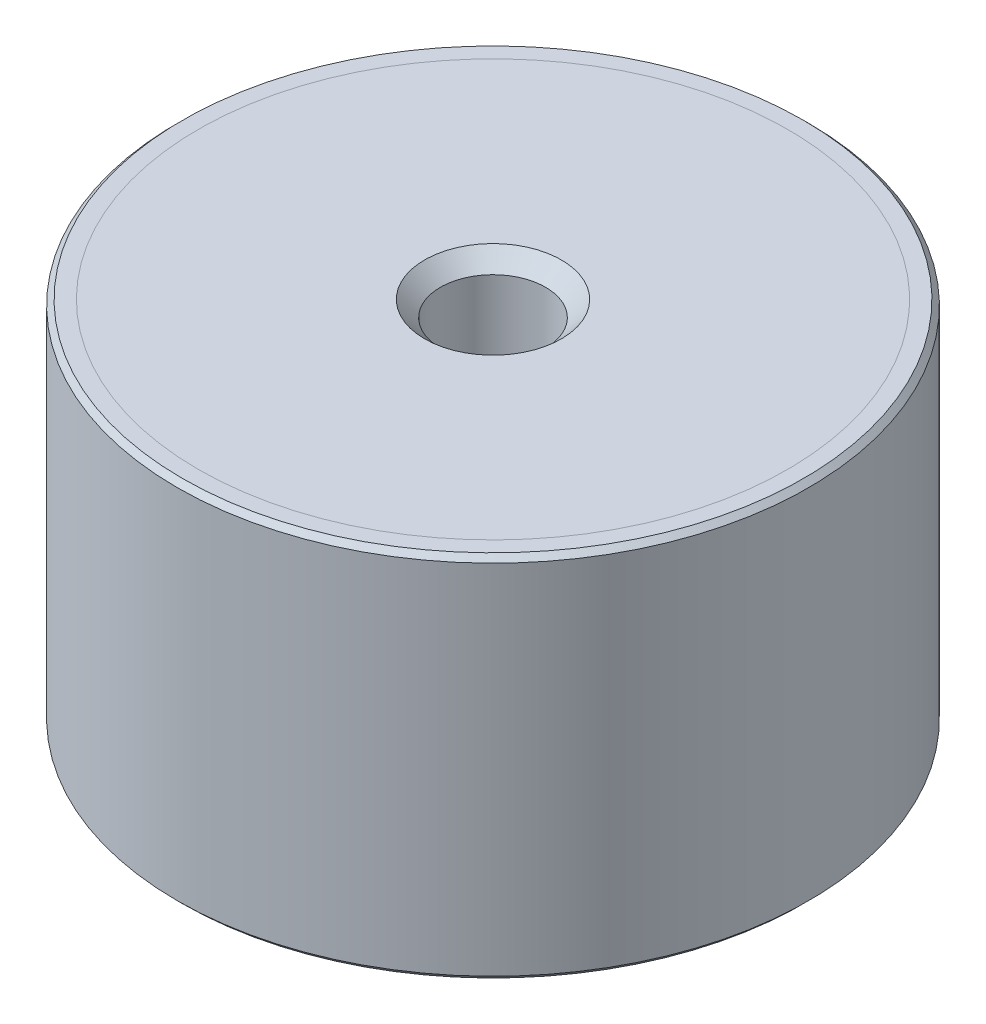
ISO-10303-21;
HEADER;
FILE_DESCRIPTION(('STEP AP214'),'2;1');
FILE_NAME('part.step','',(''),(''),'','','');
FILE_SCHEMA(('AUTOMOTIVE_DESIGN { 1 0 10303 214 1 1 1 1 }'));
ENDSEC;
DATA;
#1=APPLICATION_CONTEXT('core data for automotive mechanical design processes');
#2=APPLICATION_PROTOCOL_DEFINITION('international standard','automotive_design',2000,#1);
#3=PRODUCT_CONTEXT('',#1,'mechanical');
#4=PRODUCT('Part','Part','',(#3));
#5=PRODUCT_RELATED_PRODUCT_CATEGORY('part','',(#4));
#6=PRODUCT_DEFINITION_FORMATION('','',#4);
#7=PRODUCT_DEFINITION_CONTEXT('part definition',#1,'design');
#8=PRODUCT_DEFINITION('design','',#6,#7);
#9=PRODUCT_DEFINITION_SHAPE('','',#8);
#10=(LENGTH_UNIT() NAMED_UNIT(*) SI_UNIT(.MILLI.,.METRE.));
#11=(NAMED_UNIT(*) PLANE_ANGLE_UNIT() SI_UNIT($,.RADIAN.));
#12=(NAMED_UNIT(*) SI_UNIT($,.STERADIAN.) SOLID_ANGLE_UNIT());
#13=UNCERTAINTY_MEASURE_WITH_UNIT(LENGTH_MEASURE(1.E-05),#10,'distance_accuracy_value','');
#14=(GEOMETRIC_REPRESENTATION_CONTEXT(3) GLOBAL_UNCERTAINTY_ASSIGNED_CONTEXT((#13)) GLOBAL_UNIT_ASSIGNED_CONTEXT((#10,
#11,#12)) REPRESENTATION_CONTEXT('',''));
#15=CARTESIAN_POINT('',(0.,0.,0.));
#16=DIRECTION('',(0.,0.,1.));
#17=DIRECTION('',(1.,0.,0.));
#18=AXIS2_PLACEMENT_3D('',#15,#16,#17);
#19=CARTESIAN_POINT('',(0.,-32.,5.));
#20=DIRECTION('',(0.,1.,0.));
#21=DIRECTION('',(0.,0.,1.));
#22=AXIS2_PLACEMENT_3D('',#19,#20,#21);
#23=PLANE('',#22);
#24=CARTESIAN_POINT('',(0.,-32.,0.));
#25=DIRECTION('',(0.,1.,0.));
#26=DIRECTION('',(0.,0.,1.));
#27=AXIS2_PLACEMENT_3D('',#24,#25,#26);
#28=CIRCLE('',#27,28.);
#29=CARTESIAN_POINT('',(0.,-32.,28.));
#30=VERTEX_POINT('',#29);
#31=EDGE_CURVE('P0_E25',#30,#30,#28,.T.);
#32=ORIENTED_EDGE('',*,*,#31,.T.);
#33=EDGE_LOOP('',(#32));
#34=FACE_BOUND('',#33,.T.);
#35=CARTESIAN_POINT('',(0.,-32.,0.));
#36=DIRECTION('',(0.,1.,0.));
#37=DIRECTION('',(0.,0.,1.));
#38=AXIS2_PLACEMENT_3D('',#35,#36,#37);
#39=CIRCLE('',#38,5.);
#40=CARTESIAN_POINT('',(0.,-32.,5.));
#41=VERTEX_POINT('',#40);
#42=EDGE_CURVE('P0_E21',#41,#41,#39,.T.);
#43=ORIENTED_EDGE('',*,*,#42,.F.);
#44=EDGE_LOOP('',(#43));
#45=FACE_BOUND('',#44,.T.);
#46=ADVANCED_FACE('P0_F14',(#34,#45),#23,.T.);
#47=CARTESIAN_POINT('',(0.,36.0340428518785,0.));
#48=DIRECTION('',(0.,1.,0.));
#49=DIRECTION('',(0.,0.,1.));
#50=AXIS2_PLACEMENT_3D('',#47,#48,#49);
#51=CYLINDRICAL_SURFACE('',#50,28.);
#52=CARTESIAN_POINT('',(0.,-33.5,0.));
#53=DIRECTION('',(0.,1.,0.));
#54=DIRECTION('',(0.,0.,1.));
#55=AXIS2_PLACEMENT_3D('',#52,#53,#54);
#56=CIRCLE('',#55,28.);
#57=CARTESIAN_POINT('',(0.,-33.5,28.));
#58=VERTEX_POINT('',#57);
#59=EDGE_CURVE('P0_E29',#58,#58,#56,.T.);
#60=ORIENTED_EDGE('',*,*,#59,.T.);
#61=EDGE_LOOP('',(#60));
#62=FACE_BOUND('',#61,.T.);
#63=ORIENTED_EDGE('',*,*,#31,.F.);
#64=EDGE_LOOP('',(#63));
#65=FACE_BOUND('',#64,.T.);
#66=ADVANCED_FACE('P0_F35',(#62,#65),#51,.T.);
#67=CARTESIAN_POINT('',(0.,-33.5,28.));
#68=DIRECTION('',(0.,-1.,0.));
#69=DIRECTION('',(0.,0.,-1.));
#70=AXIS2_PLACEMENT_3D('',#67,#68,#69);
#71=PLANE('',#70);
#72=CARTESIAN_POINT('',(0.,-33.5,0.));
#73=DIRECTION('',(0.,-1.,0.));
#74=DIRECTION('',(0.,0.,-1.));
#75=AXIS2_PLACEMENT_3D('',#72,#73,#74);
#76=CIRCLE('',#75,6.49999999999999);
#77=CARTESIAN_POINT('',(0.,-33.5,-6.49999999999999));
#78=VERTEX_POINT('',#77);
#79=EDGE_CURVE('P0_E10',#78,#78,#76,.F.);
#80=ORIENTED_EDGE('',*,*,#79,.T.);
#81=EDGE_LOOP('',(#80));
#82=FACE_BOUND('',#81,.T.);
#83=ORIENTED_EDGE('',*,*,#59,.F.);
#84=EDGE_LOOP('',(#83));
#85=FACE_BOUND('',#84,.T.);
#86=ADVANCED_FACE('P0_F38',(#82,#85),#71,.T.);
#87=CARTESIAN_POINT('',(0.,-33.5,0.));
#88=DIRECTION('',(0.,-1.,0.));
#89=DIRECTION('',(0.,0.,-1.));
#90=AXIS2_PLACEMENT_3D('',#87,#88,#89);
#91=CONICAL_SURFACE('',#90,6.49999999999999,0.785398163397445);
#92=ORIENTED_EDGE('',*,*,#42,.T.);
#93=EDGE_LOOP('',(#92));
#94=FACE_BOUND('',#93,.T.);
#95=ORIENTED_EDGE('',*,*,#79,.F.);
#96=EDGE_LOOP('',(#95));
#97=FACE_BOUND('',#96,.T.);
#98=ADVANCED_FACE('P0_F16',(#94,#97),#91,.F.);
#99=CLOSED_SHELL('',(#46,#66,#86,#98));
#100=MANIFOLD_SOLID_BREP('P0_B1',#99);
#101=CARTESIAN_POINT('',(0.,1.5,5.));
#102=DIRECTION('',(0.,1.,0.));
#103=DIRECTION('',(0.,0.,1.));
#104=AXIS2_PLACEMENT_3D('',#101,#102,#103);
#105=PLANE('',#104);
#106=CARTESIAN_POINT('',(0.,1.5,0.));
#107=DIRECTION('',(0.,1.,0.));
#108=DIRECTION('',(0.,0.,1.));
#109=AXIS2_PLACEMENT_3D('',#106,#107,#108);
#110=CIRCLE('',#109,6.49999999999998);
#111=CARTESIAN_POINT('',(0.,1.5,6.49999999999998));
#112=VERTEX_POINT('',#111);
#113=EDGE_CURVE('P1_E10',#112,#112,#110,.F.);
#114=ORIENTED_EDGE('',*,*,#113,.T.);
#115=EDGE_LOOP('',(#114));
#116=FACE_BOUND('',#115,.T.);
#117=CARTESIAN_POINT('',(0.,1.5,0.));
#118=DIRECTION('',(0.,1.,0.));
#119=DIRECTION('',(0.,0.,1.));
#120=AXIS2_PLACEMENT_3D('',#117,#118,#119);
#121=CIRCLE('',#120,28.);
#122=CARTESIAN_POINT('',(0.,1.5,28.));
#123=VERTEX_POINT('',#122);
#124=EDGE_CURVE('P1_E21',#123,#123,#121,.T.);
#125=ORIENTED_EDGE('',*,*,#124,.T.);
#126=EDGE_LOOP('',(#125));
#127=FACE_BOUND('',#126,.T.);
#128=ADVANCED_FACE('P1_F14',(#116,#127),#105,.T.);
#129=CARTESIAN_POINT('',(0.,69.5340428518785,0.));
#130=DIRECTION('',(0.,1.,0.));
#131=DIRECTION('',(0.,0.,1.));
#132=AXIS2_PLACEMENT_3D('',#129,#130,#131);
#133=CYLINDRICAL_SURFACE('',#132,28.);
#134=CARTESIAN_POINT('',(0.,0.,0.));
#135=DIRECTION('',(0.,1.,0.));
#136=DIRECTION('',(0.,0.,1.));
#137=AXIS2_PLACEMENT_3D('',#134,#135,#136);
#138=CIRCLE('',#137,28.);
#139=CARTESIAN_POINT('',(0.,0.,28.));
#140=VERTEX_POINT('',#139);
#141=EDGE_CURVE('P1_E25',#140,#140,#138,.T.);
#142=ORIENTED_EDGE('',*,*,#141,.T.);
#143=EDGE_LOOP('',(#142));
#144=FACE_BOUND('',#143,.T.);
#145=ORIENTED_EDGE('',*,*,#124,.F.);
#146=EDGE_LOOP('',(#145));
#147=FACE_BOUND('',#146,.T.);
#148=ADVANCED_FACE('P1_F44',(#144,#147),#133,.T.);
#149=CARTESIAN_POINT('',(0.,0.,28.));
#150=DIRECTION('',(0.,-1.,0.));
#151=DIRECTION('',(0.,0.,-1.));
#152=AXIS2_PLACEMENT_3D('',#149,#150,#151);
#153=PLANE('',#152);
#154=CARTESIAN_POINT('',(0.,0.,0.));
#155=DIRECTION('',(0.,1.,0.));
#156=DIRECTION('',(0.,0.,1.));
#157=AXIS2_PLACEMENT_3D('',#154,#155,#156);
#158=CIRCLE('',#157,5.);
#159=CARTESIAN_POINT('',(0.,0.,4.99999999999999));
#160=VERTEX_POINT('',#159);
#161=EDGE_CURVE('P1_E29',#160,#160,#158,.T.);
#162=ORIENTED_EDGE('',*,*,#161,.T.);
#163=EDGE_LOOP('',(#162));
#164=FACE_BOUND('',#163,.T.);
#165=ORIENTED_EDGE('',*,*,#141,.F.);
#166=EDGE_LOOP('',(#165));
#167=FACE_BOUND('',#166,.T.);
#168=ADVANCED_FACE('P1_F35',(#164,#167),#153,.T.);
#169=CARTESIAN_POINT('',(0.,0.,0.));
#170=DIRECTION('',(0.,1.,0.));
#171=DIRECTION('',(0.,0.,1.));
#172=AXIS2_PLACEMENT_3D('',#169,#170,#171);
#173=CONICAL_SURFACE('',#172,5.,0.785398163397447);
#174=CARTESIAN_POINT('',(0.,1.5,6.49999999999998));
#175=CARTESIAN_POINT('',(0.,1.484375,6.48437499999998));
#176=CARTESIAN_POINT('',(0.,1.46875,6.46874999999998));
#177=CARTESIAN_POINT('',(0.,1.4375,6.43749999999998));
#178=CARTESIAN_POINT('',(0.,1.421875,6.42187499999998));
#179=CARTESIAN_POINT('',(0.,1.390625,6.39062499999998));
#180=CARTESIAN_POINT('',(0.,1.375,6.37499999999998));
#181=CARTESIAN_POINT('',(0.,1.34375,6.34374999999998));
#182=CARTESIAN_POINT('',(0.,1.328125,6.32812499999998));
#183=CARTESIAN_POINT('',(0.,1.296875,6.29687499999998));
#184=CARTESIAN_POINT('',(0.,1.28125,6.28124999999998));
#185=CARTESIAN_POINT('',(0.,1.25,6.24999999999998));
#186=CARTESIAN_POINT('',(0.,1.234375,6.23437499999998));
#187=CARTESIAN_POINT('',(0.,1.203125,6.20312499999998));
#188=CARTESIAN_POINT('',(0.,1.1875,6.18749999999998));
#189=CARTESIAN_POINT('',(0.,1.15625,6.15624999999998));
#190=CARTESIAN_POINT('',(0.,1.140625,6.14062499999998));
#191=CARTESIAN_POINT('',(0.,1.109375,6.10937499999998));
#192=CARTESIAN_POINT('',(0.,1.09375,6.09374999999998));
#193=CARTESIAN_POINT('',(0.,1.0625,6.06249999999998));
#194=CARTESIAN_POINT('',(0.,1.046875,6.04687499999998));
#195=CARTESIAN_POINT('',(0.,1.015625,6.01562499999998));
#196=CARTESIAN_POINT('',(0.,0.999999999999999,5.99999999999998));
#197=CARTESIAN_POINT('',(0.,0.968749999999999,5.96874999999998));
#198=CARTESIAN_POINT('',(0.,0.953124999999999,5.95312499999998));
#199=CARTESIAN_POINT('',(0.,0.921874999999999,5.92187499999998));
#200=CARTESIAN_POINT('',(0.,0.906249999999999,5.90624999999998));
#201=CARTESIAN_POINT('',(0.,0.874999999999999,5.87499999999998));
#202=CARTESIAN_POINT('',(0.,0.859374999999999,5.85937499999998));
#203=CARTESIAN_POINT('',(0.,0.828124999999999,5.82812499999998));
#204=CARTESIAN_POINT('',(0.,0.812499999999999,5.81249999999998));
#205=CARTESIAN_POINT('',(0.,0.781249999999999,5.78124999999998));
#206=CARTESIAN_POINT('',(0.,0.765624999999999,5.76562499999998));
#207=CARTESIAN_POINT('',(0.,0.734374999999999,5.73437499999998));
#208=CARTESIAN_POINT('',(0.,0.718749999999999,5.71874999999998));
#209=CARTESIAN_POINT('',(0.,0.687499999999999,5.68749999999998));
#210=CARTESIAN_POINT('',(0.,0.671874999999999,5.67187499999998));
#211=CARTESIAN_POINT('',(0.,0.640624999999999,5.64062499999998));
#212=CARTESIAN_POINT('',(0.,0.624999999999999,5.62499999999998));
#213=CARTESIAN_POINT('',(0.,0.593749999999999,5.59374999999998));
#214=CARTESIAN_POINT('',(0.,0.578124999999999,5.57812499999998));
#215=CARTESIAN_POINT('',(0.,0.546874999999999,5.54687499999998));
#216=CARTESIAN_POINT('',(0.,0.531249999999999,5.53124999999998));
#217=CARTESIAN_POINT('',(0.,0.499999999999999,5.49999999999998));
#218=CARTESIAN_POINT('',(0.,0.484374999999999,5.48437499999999));
#219=CARTESIAN_POINT('',(0.,0.453124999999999,5.45312499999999));
#220=CARTESIAN_POINT('',(0.,0.437499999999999,5.43749999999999));
#221=CARTESIAN_POINT('',(0.,0.406249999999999,5.40624999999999));
#222=CARTESIAN_POINT('',(0.,0.390624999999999,5.39062499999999));
#223=CARTESIAN_POINT('',(0.,0.359374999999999,5.35937499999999));
#224=CARTESIAN_POINT('',(0.,0.343749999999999,5.34374999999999));
#225=CARTESIAN_POINT('',(0.,0.312499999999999,5.31249999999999));
#226=CARTESIAN_POINT('',(0.,0.296874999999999,5.29687499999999));
#227=CARTESIAN_POINT('',(0.,0.265624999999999,5.26562499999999));
#228=CARTESIAN_POINT('',(0.,0.249999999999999,5.24999999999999));
#229=CARTESIAN_POINT('',(0.,0.218749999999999,5.21874999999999));
#230=CARTESIAN_POINT('',(0.,0.203124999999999,5.20312499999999));
#231=CARTESIAN_POINT('',(0.,0.171874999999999,5.17187499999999));
#232=CARTESIAN_POINT('',(0.,0.156249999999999,5.15624999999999));
#233=CARTESIAN_POINT('',(0.,0.124999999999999,5.12499999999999));
#234=CARTESIAN_POINT('',(0.,0.109374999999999,5.10937499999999));
#235=CARTESIAN_POINT('',(0.,0.0781249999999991,5.07812499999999));
#236=CARTESIAN_POINT('',(0.,0.0624999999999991,5.06249999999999));
#237=CARTESIAN_POINT('',(0.,0.0312499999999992,5.03124999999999));
#238=CARTESIAN_POINT('',(0.,0.0156249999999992,5.01562499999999));
#239=CARTESIAN_POINT('',(0.,0.,4.99999999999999));
#240=B_SPLINE_CURVE_WITH_KNOTS('',3,(#174,#175,#176,#177,#178,#179,#180,#181,#182,#183,#184,
#185,#186,#187,#188,#189,#190,#191,#192,#193,#194,#195,#196,#197,#198,#199,#200,#201,#202,#203,
#204,#205,#206,#207,#208,#209,#210,#211,#212,#213,#214,#215,#216,#217,#218,#219,#220,#221,#222,
#223,#224,#225,#226,#227,#228,#229,#230,#231,#232,#233,#234,#235,#236,#237,#238,#239),
.UNSPECIFIED.,.F.,.F.,(4,2,2,2,2,2,2,2,2,2,2,2,2,2,2,2,2,2,2,2,2,2,2,2,2,2,2,2,2,2,2,2,4),(0.,
0.0662912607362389,0.132582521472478,0.198873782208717,0.265165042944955,0.331456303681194,
0.397747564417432,0.464038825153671,0.53033008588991,0.596621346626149,0.662912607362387,
0.729203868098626,0.795495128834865,0.861786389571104,0.928077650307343,0.994368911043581,
1.06066017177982,1.12695143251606,1.1932426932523,1.25953395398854,1.32582521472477,
1.39211647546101,1.45840773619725,1.52469899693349,1.59099025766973,1.65728151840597,
1.72357277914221,1.78986403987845,1.85615530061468,1.92244656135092,1.98873782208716,
2.0550290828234,2.12132034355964),.UNSPECIFIED.);
#241=EDGE_CURVE('P1_BSEAM16',#112,#160,#240,.T.);
#242=ORIENTED_EDGE('',*,*,#113,.F.);
#243=ORIENTED_EDGE('',*,*,#161,.F.);
#244=ORIENTED_EDGE('',*,*,#241,.T.);
#245=ORIENTED_EDGE('',*,*,#241,.F.);
#246=EDGE_LOOP('',(#242,#244,#243,#245));
#247=FACE_BOUND('',#246,.T.);
#248=ADVANCED_FACE('P1_F16',(#247),#173,.F.);
#249=CLOSED_SHELL('',(#128,#148,#168,#248));
#250=MANIFOLD_SOLID_BREP('P1_B1',#249);
#251=CARTESIAN_POINT('',(0.,0.,0.));
#252=DIRECTION('',(0.,1.,0.));
#253=DIRECTION('',(0.,0.,1.));
#254=AXIS2_PLACEMENT_3D('',#251,#252,#253);
#255=PLANE('',#254);
#256=CARTESIAN_POINT('',(0.,0.,0.));
#257=DIRECTION('',(0.,1.,0.));
#258=DIRECTION('',(0.,0.,1.));
#259=AXIS2_PLACEMENT_3D('',#256,#257,#258);
#260=CIRCLE('',#259,5.);
#261=CARTESIAN_POINT('',(0.,0.,5.));
#262=VERTEX_POINT('',#261);
#263=EDGE_CURVE('P2_E46',#262,#262,#260,.T.);
#264=ORIENTED_EDGE('',*,*,#263,.F.);
#265=EDGE_LOOP('',(#264));
#266=FACE_BOUND('',#265,.T.);
#267=CARTESIAN_POINT('',(0.,0.,0.));
#268=DIRECTION('',(0.,1.,0.));
#269=DIRECTION('',(0.,0.,1.));
#270=AXIS2_PLACEMENT_3D('',#267,#268,#269);
#271=CIRCLE('',#270,28.);
#272=CARTESIAN_POINT('',(0.,0.,28.));
#273=VERTEX_POINT('',#272);
#274=EDGE_CURVE('P2_E33',#273,#273,#271,.T.);
#275=ORIENTED_EDGE('',*,*,#274,.T.);
#276=EDGE_LOOP('',(#275));
#277=FACE_BOUND('',#276,.T.);
#278=ADVANCED_FACE('P2_F13',(#266,#277),#255,.T.);
#279=CARTESIAN_POINT('',(0.,65.5134936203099,0.));
#280=DIRECTION('',(0.,1.,0.));
#281=DIRECTION('',(0.,0.,1.));
#282=AXIS2_PLACEMENT_3D('',#279,#280,#281);
#283=CYLINDRICAL_SURFACE('',#282,28.);
#284=CARTESIAN_POINT('',(0.,1.5,0.));
#285=DIRECTION('',(0.,1.,0.));
#286=DIRECTION('',(0.,0.,1.));
#287=AXIS2_PLACEMENT_3D('',#284,#285,#286);
#288=CIRCLE('',#287,28.);
#289=CARTESIAN_POINT('',(0.,1.5,28.));
#290=VERTEX_POINT('',#289);
#291=EDGE_CURVE('P2_E36',#290,#290,#288,.T.);
#292=ORIENTED_EDGE('',*,*,#291,.T.);
#293=EDGE_LOOP('',(#292));
#294=FACE_BOUND('',#293,.T.);
#295=ORIENTED_EDGE('',*,*,#274,.F.);
#296=EDGE_LOOP('',(#295));
#297=FACE_BOUND('',#296,.T.);
#298=ADVANCED_FACE('P2_F92',(#294,#297),#283,.F.);
#299=CARTESIAN_POINT('',(0.,1.5,28.));
#300=DIRECTION('',(0.,1.,0.));
#301=DIRECTION('',(0.,0.,1.));
#302=AXIS2_PLACEMENT_3D('',#299,#300,#301);
#303=PLANE('',#302);
#304=CARTESIAN_POINT('',(0.,1.5,0.));
#305=DIRECTION('',(0.,1.,0.));
#306=DIRECTION('',(0.,0.,1.));
#307=AXIS2_PLACEMENT_3D('',#304,#305,#306);
#308=CIRCLE('',#307,29.5);
#309=CARTESIAN_POINT('',(0.,1.5,29.5));
#310=VERTEX_POINT('',#309);
#311=EDGE_CURVE('P2_E9',#310,#310,#308,.T.);
#312=ORIENTED_EDGE('',*,*,#311,.T.);
#313=EDGE_LOOP('',(#312));
#314=FACE_BOUND('',#313,.T.);
#315=ORIENTED_EDGE('',*,*,#291,.F.);
#316=EDGE_LOOP('',(#315));
#317=FACE_BOUND('',#316,.T.);
#318=ADVANCED_FACE('P2_F88',(#314,#317),#303,.T.);
#319=CARTESIAN_POINT('',(0.,65.5134936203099,0.));
#320=DIRECTION('',(0.,1.,0.));
#321=DIRECTION('',(0.,0.,1.));
#322=AXIS2_PLACEMENT_3D('',#319,#320,#321);
#323=CYLINDRICAL_SURFACE('',#322,30.);
#324=CARTESIAN_POINT('',(0.,-33.,0.));
#325=DIRECTION('',(0.,-1.,0.));
#326=DIRECTION('',(0.,0.,-1.));
#327=AXIS2_PLACEMENT_3D('',#324,#325,#326);
#328=CIRCLE('',#327,30.);
#329=CARTESIAN_POINT('',(0.,-33.,-30.));
#330=VERTEX_POINT('',#329);
#331=EDGE_CURVE('P2_E24',#330,#330,#328,.F.);
#332=ORIENTED_EDGE('',*,*,#331,.T.);
#333=EDGE_LOOP('',(#332));
#334=FACE_BOUND('',#333,.T.);
#335=CARTESIAN_POINT('',(0.,0.999999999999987,0.));
#336=DIRECTION('',(0.,1.,0.));
#337=DIRECTION('',(0.,0.,1.));
#338=AXIS2_PLACEMENT_3D('',#335,#336,#337);
#339=CIRCLE('',#338,30.);
#340=CARTESIAN_POINT('',(0.,0.999999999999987,30.));
#341=VERTEX_POINT('',#340);
#342=EDGE_CURVE('P2_E28',#341,#341,#339,.F.);
#343=ORIENTED_EDGE('',*,*,#342,.T.);
#344=EDGE_LOOP('',(#343));
#345=FACE_BOUND('',#344,.T.);
#346=ADVANCED_FACE('P2_F82',(#334,#345),#323,.T.);
#347=CARTESIAN_POINT('',(0.,-33.5,30.));
#348=DIRECTION('',(0.,-1.,0.));
#349=DIRECTION('',(0.,0.,-1.));
#350=AXIS2_PLACEMENT_3D('',#347,#348,#349);
#351=PLANE('',#350);
#352=CARTESIAN_POINT('',(0.,-33.5,0.));
#353=DIRECTION('',(0.,-1.,0.));
#354=DIRECTION('',(0.,0.,-1.));
#355=AXIS2_PLACEMENT_3D('',#352,#353,#354);
#356=CIRCLE('',#355,29.5);
#357=CARTESIAN_POINT('',(0.,-33.5,-29.5));
#358=VERTEX_POINT('',#357);
#359=EDGE_CURVE('P2_E20',#358,#358,#356,.T.);
#360=ORIENTED_EDGE('',*,*,#359,.T.);
#361=EDGE_LOOP('',(#360));
#362=FACE_BOUND('',#361,.T.);
#363=CARTESIAN_POINT('',(0.,-33.5,0.));
#364=DIRECTION('',(0.,1.,0.));
#365=DIRECTION('',(0.,0.,1.));
#366=AXIS2_PLACEMENT_3D('',#363,#364,#365);
#367=CIRCLE('',#366,28.);
#368=CARTESIAN_POINT('',(0.,-33.5,28.));
#369=VERTEX_POINT('',#368);
#370=EDGE_CURVE('P2_E39',#369,#369,#367,.T.);
#371=ORIENTED_EDGE('',*,*,#370,.T.);
#372=EDGE_LOOP('',(#371));
#373=FACE_BOUND('',#372,.T.);
#374=ADVANCED_FACE('P2_F77',(#362,#373),#351,.T.);
#375=CARTESIAN_POINT('',(0.,65.5134936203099,0.));
#376=DIRECTION('',(0.,1.,0.));
#377=DIRECTION('',(0.,0.,1.));
#378=AXIS2_PLACEMENT_3D('',#375,#376,#377);
#379=CYLINDRICAL_SURFACE('',#378,28.);
#380=CARTESIAN_POINT('',(0.,-32.,0.));
#381=DIRECTION('',(0.,1.,0.));
#382=DIRECTION('',(0.,0.,1.));
#383=AXIS2_PLACEMENT_3D('',#380,#381,#382);
#384=CIRCLE('',#383,28.);
#385=CARTESIAN_POINT('',(0.,-32.,28.));
#386=VERTEX_POINT('',#385);
#387=EDGE_CURVE('P2_E42',#386,#386,#384,.T.);
#388=ORIENTED_EDGE('',*,*,#387,.T.);
#389=EDGE_LOOP('',(#388));
#390=FACE_BOUND('',#389,.T.);
#391=ORIENTED_EDGE('',*,*,#370,.F.);
#392=EDGE_LOOP('',(#391));
#393=FACE_BOUND('',#392,.T.);
#394=ADVANCED_FACE('P2_F71',(#390,#393),#379,.F.);
#395=CARTESIAN_POINT('',(0.,-32.,28.));
#396=DIRECTION('',(0.,-1.,0.));
#397=DIRECTION('',(0.,0.,-1.));
#398=AXIS2_PLACEMENT_3D('',#395,#396,#397);
#399=PLANE('',#398);
#400=CARTESIAN_POINT('',(0.,-32.,0.));
#401=DIRECTION('',(0.,-1.,0.));
#402=DIRECTION('',(0.,0.,-1.));
#403=AXIS2_PLACEMENT_3D('',#400,#401,#402);
#404=CIRCLE('',#403,5.);
#405=CARTESIAN_POINT('',(0.,-32.,-5.));
#406=VERTEX_POINT('',#405);
#407=EDGE_CURVE('P2_E52',#406,#406,#404,.T.);
#408=ORIENTED_EDGE('',*,*,#407,.F.);
#409=EDGE_LOOP('',(#408));
#410=FACE_BOUND('',#409,.T.);
#411=ORIENTED_EDGE('',*,*,#387,.F.);
#412=EDGE_LOOP('',(#411));
#413=FACE_BOUND('',#412,.T.);
#414=ADVANCED_FACE('P2_F67',(#410,#413),#399,.T.);
#415=CARTESIAN_POINT('',(0.,-33.,0.));
#416=DIRECTION('',(0.,1.,0.));
#417=DIRECTION('',(0.,0.,1.));
#418=AXIS2_PLACEMENT_3D('',#415,#416,#417);
#419=CONICAL_SURFACE('',#418,30.,0.785398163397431);
#420=ORIENTED_EDGE('',*,*,#359,.F.);
#421=EDGE_LOOP('',(#420));
#422=FACE_BOUND('',#421,.T.);
#423=ORIENTED_EDGE('',*,*,#331,.F.);
#424=EDGE_LOOP('',(#423));
#425=FACE_BOUND('',#424,.T.);
#426=ADVANCED_FACE('P2_F70',(#422,#425),#419,.T.);
#427=CARTESIAN_POINT('',(0.,1.5,0.));
#428=DIRECTION('',(0.,-1.,0.));
#429=DIRECTION('',(0.,0.,-1.));
#430=AXIS2_PLACEMENT_3D('',#427,#428,#429);
#431=CONICAL_SURFACE('',#430,29.5,0.785398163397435);
#432=ORIENTED_EDGE('',*,*,#342,.F.);
#433=EDGE_LOOP('',(#432));
#434=FACE_BOUND('',#433,.T.);
#435=ORIENTED_EDGE('',*,*,#311,.F.);
#436=EDGE_LOOP('',(#435));
#437=FACE_BOUND('',#436,.T.);
#438=ADVANCED_FACE('P2_F15',(#434,#437),#431,.T.);
#439=CARTESIAN_POINT('',(0.,-8.5,0.));
#440=DIRECTION('',(0.,1.,0.));
#441=DIRECTION('',(0.,0.,1.));
#442=AXIS2_PLACEMENT_3D('',#439,#440,#441);
#443=CYLINDRICAL_SURFACE('',#442,5.);
#444=CARTESIAN_POINT('',(0.,-8.5,0.));
#445=DIRECTION('',(0.,1.,0.));
#446=DIRECTION('',(0.,0.,1.));
#447=AXIS2_PLACEMENT_3D('',#444,#445,#446);
#448=CIRCLE('',#447,5.);
#449=CARTESIAN_POINT('',(0.,-8.5,5.));
#450=VERTEX_POINT('',#449);
#451=EDGE_CURVE('P2_E45',#450,#450,#448,.T.);
#452=ORIENTED_EDGE('',*,*,#451,.F.);
#453=EDGE_LOOP('',(#452));
#454=FACE_BOUND('',#453,.T.);
#455=ORIENTED_EDGE('',*,*,#263,.T.);
#456=EDGE_LOOP('',(#455));
#457=FACE_BOUND('',#456,.T.);
#458=ADVANCED_FACE('P2_F108',(#454,#457),#443,.F.);
#459=CARTESIAN_POINT('',(0.,-8.5,0.));
#460=DIRECTION('',(0.,1.,0.));
#461=DIRECTION('',(0.,0.,1.));
#462=AXIS2_PLACEMENT_3D('',#459,#460,#461);
#463=PLANE('',#462);
#464=ORIENTED_EDGE('',*,*,#451,.T.);
#465=EDGE_LOOP('',(#464));
#466=FACE_BOUND('',#465,.T.);
#467=ADVANCED_FACE('P2_F63',(#466),#463,.T.);
#468=CARTESIAN_POINT('',(0.,-23.5,0.));
#469=DIRECTION('',(0.,-1.,0.));
#470=DIRECTION('',(0.,0.,-1.));
#471=AXIS2_PLACEMENT_3D('',#468,#469,#470);
#472=CYLINDRICAL_SURFACE('',#471,5.);
#473=CARTESIAN_POINT('',(0.,-23.5,0.));
#474=DIRECTION('',(0.,-1.,0.));
#475=DIRECTION('',(0.,0.,-1.));
#476=AXIS2_PLACEMENT_3D('',#473,#474,#475);
#477=CIRCLE('',#476,5.);
#478=CARTESIAN_POINT('',(0.,-23.5,-5.));
#479=VERTEX_POINT('',#478);
#480=EDGE_CURVE('P2_E49',#479,#479,#477,.T.);
#481=ORIENTED_EDGE('',*,*,#480,.F.);
#482=EDGE_LOOP('',(#481));
#483=FACE_BOUND('',#482,.T.);
#484=ORIENTED_EDGE('',*,*,#407,.T.);
#485=EDGE_LOOP('',(#484));
#486=FACE_BOUND('',#485,.T.);
#487=ADVANCED_FACE('P2_F60',(#483,#486),#472,.F.);
#488=CARTESIAN_POINT('',(0.,-23.5,0.));
#489=DIRECTION('',(0.,-1.,0.));
#490=DIRECTION('',(0.,0.,-1.));
#491=AXIS2_PLACEMENT_3D('',#488,#489,#490);
#492=PLANE('',#491);
#493=ORIENTED_EDGE('',*,*,#480,.T.);
#494=EDGE_LOOP('',(#493));
#495=FACE_BOUND('',#494,.T.);
#496=ADVANCED_FACE('P2_F58',(#495),#492,.T.);
#497=CLOSED_SHELL('',(#278,#298,#318,#346,#374,#394,#414,#426,#438,#458,#467,#487,#496));
#498=MANIFOLD_SOLID_BREP('P2_B1',#497);
#499=ADVANCED_BREP_SHAPE_REPRESENTATION('',(#18,#100,#250,#498),#14);
#500=SHAPE_DEFINITION_REPRESENTATION(#9,#499);
ENDSEC;
END-ISO-10303-21;
